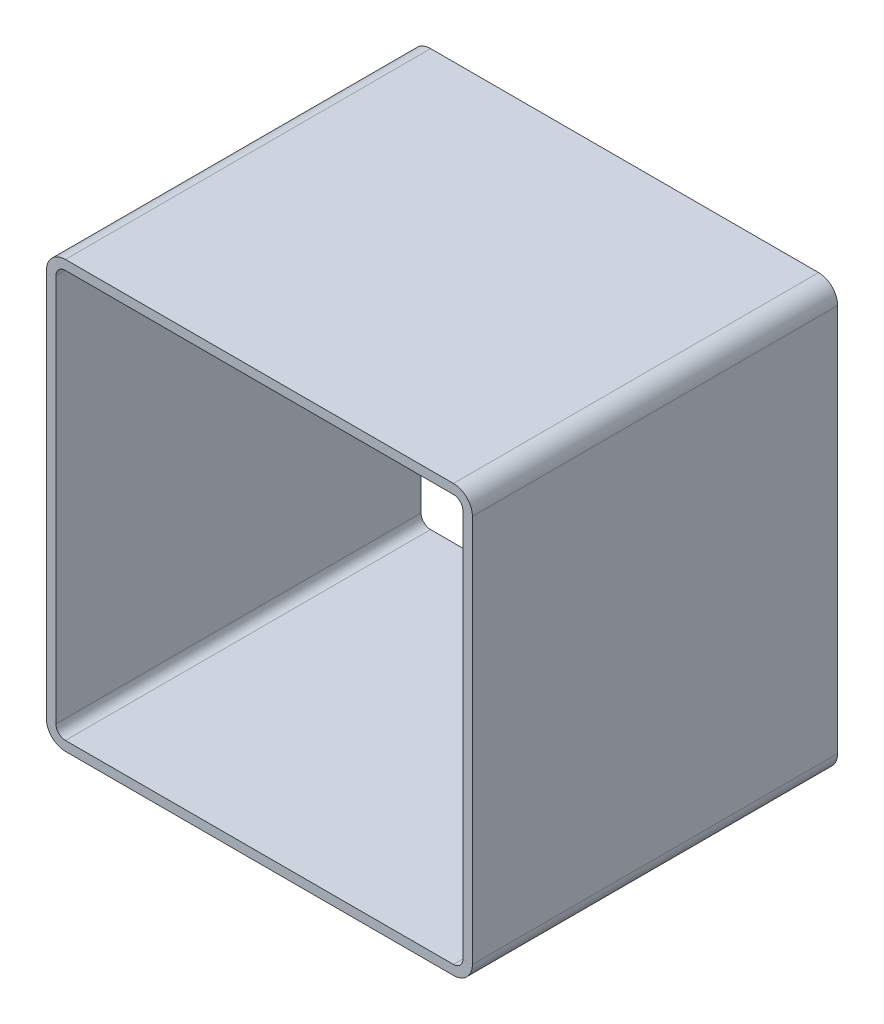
ISO-10303-21;
HEADER;
FILE_DESCRIPTION(('STEP AP214'),'2;1');
FILE_NAME('part.step','',(''),(''),'','','');
FILE_SCHEMA(('AUTOMOTIVE_DESIGN { 1 0 10303 214 1 1 1 1 }'));
ENDSEC;
DATA;
#1=APPLICATION_CONTEXT('core data for automotive mechanical design processes');
#2=APPLICATION_PROTOCOL_DEFINITION('international standard','automotive_design',2000,#1);
#3=PRODUCT_CONTEXT('',#1,'mechanical');
#4=PRODUCT('Part','Part','',(#3));
#5=PRODUCT_RELATED_PRODUCT_CATEGORY('part','',(#4));
#6=PRODUCT_DEFINITION_FORMATION('','',#4);
#7=PRODUCT_DEFINITION_CONTEXT('part definition',#1,'design');
#8=PRODUCT_DEFINITION('design','',#6,#7);
#9=PRODUCT_DEFINITION_SHAPE('','',#8);
#10=(LENGTH_UNIT() NAMED_UNIT(*) SI_UNIT(.MILLI.,.METRE.));
#11=(NAMED_UNIT(*) PLANE_ANGLE_UNIT() SI_UNIT($,.RADIAN.));
#12=(NAMED_UNIT(*) SI_UNIT($,.STERADIAN.) SOLID_ANGLE_UNIT());
#13=UNCERTAINTY_MEASURE_WITH_UNIT(LENGTH_MEASURE(1.E-05),#10,'distance_accuracy_value','');
#14=(GEOMETRIC_REPRESENTATION_CONTEXT(3) GLOBAL_UNCERTAINTY_ASSIGNED_CONTEXT((#13)) GLOBAL_UNIT_ASSIGNED_CONTEXT((#10,
#11,#12)) REPRESENTATION_CONTEXT('',''));
#15=CARTESIAN_POINT('',(0.,0.,0.));
#16=DIRECTION('',(0.,0.,1.));
#17=DIRECTION('',(1.,0.,0.));
#18=AXIS2_PLACEMENT_3D('',#15,#16,#17);
#19=CARTESIAN_POINT('',(18.3253420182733,341.553679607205,304.8));
#20=DIRECTION('',(0.,0.,1.));
#21=DIRECTION('',(1.,0.,0.));
#22=AXIS2_PLACEMENT_3D('',#19,#20,#21);
#23=PLANE('',#22);
#24=CARTESIAN_POINT('',(18.3253420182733,341.553679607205,304.8));
#25=DIRECTION('',(0.,0.,1.));
#26=DIRECTION('',(1.,0.,0.));
#27=AXIS2_PLACEMENT_3D('',#24,#25,#26);
#28=CIRCLE('',#27,15.875);
#29=CARTESIAN_POINT('',(18.3253420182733,357.428679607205,304.8));
#30=VERTEX_POINT('',#29);
#31=CARTESIAN_POINT('',(2.45034201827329,341.553679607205,304.8));
#32=VERTEX_POINT('',#31);
#33=EDGE_CURVE('E211',#30,#32,#28,.T.);
#34=ORIENTED_EDGE('',*,*,#33,.T.);
#35=DIRECTION('',(0.,-1.,0.));
#36=VECTOR('',#35,1.);
#37=CARTESIAN_POINT('',(2.45034201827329,17.7036796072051,304.8));
#38=LINE('',#37,#36);
#39=CARTESIAN_POINT('',(2.4503420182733,17.7036796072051,304.8));
#40=VERTEX_POINT('',#39);
#41=EDGE_CURVE('E214',#32,#40,#38,.T.);
#42=ORIENTED_EDGE('',*,*,#41,.T.);
#43=CARTESIAN_POINT('',(18.3253420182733,17.7036796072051,304.8));
#44=DIRECTION('',(0.,0.,1.));
#45=DIRECTION('',(1.,0.,0.));
#46=AXIS2_PLACEMENT_3D('',#43,#44,#45);
#47=CIRCLE('',#46,15.875);
#48=CARTESIAN_POINT('',(18.3253420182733,1.82867960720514,304.8));
#49=VERTEX_POINT('',#48);
#50=EDGE_CURVE('E217',#40,#49,#47,.T.);
#51=ORIENTED_EDGE('',*,*,#50,.T.);
#52=DIRECTION('',(1.,0.,0.));
#53=VECTOR('',#52,1.);
#54=CARTESIAN_POINT('',(342.175342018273,1.82867960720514,304.8));
#55=LINE('',#54,#53);
#56=CARTESIAN_POINT('',(342.175342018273,1.82867960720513,304.8));
#57=VERTEX_POINT('',#56);
#58=EDGE_CURVE('E219',#49,#57,#55,.T.);
#59=ORIENTED_EDGE('',*,*,#58,.T.);
#60=CARTESIAN_POINT('',(342.175342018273,17.7036796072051,304.8));
#61=DIRECTION('',(0.,0.,1.));
#62=DIRECTION('',(1.,0.,0.));
#63=AXIS2_PLACEMENT_3D('',#60,#61,#62);
#64=CIRCLE('',#63,15.875);
#65=CARTESIAN_POINT('',(358.050342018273,17.7036796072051,304.8));
#66=VERTEX_POINT('',#65);
#67=EDGE_CURVE('E221',#57,#66,#64,.T.);
#68=ORIENTED_EDGE('',*,*,#67,.T.);
#69=DIRECTION('',(0.,1.,0.));
#70=VECTOR('',#69,1.);
#71=CARTESIAN_POINT('',(358.050342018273,341.553679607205,304.8));
#72=LINE('',#71,#70);
#73=CARTESIAN_POINT('',(358.050342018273,341.553679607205,304.8));
#74=VERTEX_POINT('',#73);
#75=EDGE_CURVE('E223',#66,#74,#72,.T.);
#76=ORIENTED_EDGE('',*,*,#75,.T.);
#77=CARTESIAN_POINT('',(342.175342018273,341.553679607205,304.8));
#78=DIRECTION('',(0.,0.,1.));
#79=DIRECTION('',(1.,0.,0.));
#80=AXIS2_PLACEMENT_3D('',#77,#78,#79);
#81=CIRCLE('',#80,15.875);
#82=CARTESIAN_POINT('',(342.175342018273,357.428679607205,304.8));
#83=VERTEX_POINT('',#82);
#84=EDGE_CURVE('E225',#74,#83,#81,.T.);
#85=ORIENTED_EDGE('',*,*,#84,.T.);
#86=DIRECTION('',(-1.,0.,0.));
#87=VECTOR('',#86,1.);
#88=CARTESIAN_POINT('',(18.3253420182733,357.428679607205,304.8));
#89=LINE('',#88,#87);
#90=EDGE_CURVE('E227',#83,#30,#89,.T.);
#91=ORIENTED_EDGE('',*,*,#90,.T.);
#92=EDGE_LOOP('',(#34,#42,#51,#59,#68,#76,#85,#91));
#93=FACE_BOUND('',#92,.T.);
#94=DIRECTION('',(0.,-1.,0.));
#95=VECTOR('',#94,1.);
#96=CARTESIAN_POINT('',(10.3878420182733,17.7036796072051,304.8));
#97=LINE('',#96,#95);
#98=CARTESIAN_POINT('',(10.3878420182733,341.553679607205,304.8));
#99=VERTEX_POINT('',#98);
#100=CARTESIAN_POINT('',(10.3878420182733,17.7036796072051,304.8));
#101=VERTEX_POINT('',#100);
#102=EDGE_CURVE('E154',#99,#101,#97,.T.);
#103=ORIENTED_EDGE('',*,*,#102,.F.);
#104=CARTESIAN_POINT('',(18.3253420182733,341.553679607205,304.8));
#105=DIRECTION('',(0.,0.,1.));
#106=DIRECTION('',(1.,0.,0.));
#107=AXIS2_PLACEMENT_3D('',#104,#105,#106);
#108=CIRCLE('',#107,7.93749999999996);
#109=CARTESIAN_POINT('',(18.3253420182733,349.491179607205,304.8));
#110=VERTEX_POINT('',#109);
#111=EDGE_CURVE('E146',#110,#99,#108,.T.);
#112=ORIENTED_EDGE('',*,*,#111,.F.);
#113=DIRECTION('',(-1.,0.,0.));
#114=VECTOR('',#113,1.);
#115=CARTESIAN_POINT('',(18.3253420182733,349.491179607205,304.8));
#116=LINE('',#115,#114);
#117=CARTESIAN_POINT('',(342.175342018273,349.491179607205,304.8));
#118=VERTEX_POINT('',#117);
#119=EDGE_CURVE('E179',#118,#110,#116,.T.);
#120=ORIENTED_EDGE('',*,*,#119,.F.);
#121=CARTESIAN_POINT('',(342.175342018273,341.553679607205,304.8));
#122=DIRECTION('',(0.,0.,1.));
#123=DIRECTION('',(1.,0.,0.));
#124=AXIS2_PLACEMENT_3D('',#121,#122,#123);
#125=CIRCLE('',#124,7.93749999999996);
#126=CARTESIAN_POINT('',(350.112842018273,341.553679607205,304.8));
#127=VERTEX_POINT('',#126);
#128=EDGE_CURVE('E177',#127,#118,#125,.T.);
#129=ORIENTED_EDGE('',*,*,#128,.F.);
#130=DIRECTION('',(0.,1.,0.));
#131=VECTOR('',#130,1.);
#132=CARTESIAN_POINT('',(350.112842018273,341.553679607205,304.8));
#133=LINE('',#132,#131);
#134=CARTESIAN_POINT('',(350.112842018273,17.7036796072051,304.8));
#135=VERTEX_POINT('',#134);
#136=EDGE_CURVE('E175',#135,#127,#133,.T.);
#137=ORIENTED_EDGE('',*,*,#136,.F.);
#138=CARTESIAN_POINT('',(342.175342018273,17.7036796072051,304.8));
#139=DIRECTION('',(0.,0.,1.));
#140=DIRECTION('',(1.,0.,0.));
#141=AXIS2_PLACEMENT_3D('',#138,#139,#140);
#142=CIRCLE('',#141,7.9375);
#143=CARTESIAN_POINT('',(342.175342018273,9.76617960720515,304.8));
#144=VERTEX_POINT('',#143);
#145=EDGE_CURVE('E173',#144,#135,#142,.T.);
#146=ORIENTED_EDGE('',*,*,#145,.F.);
#147=DIRECTION('',(1.,0.,0.));
#148=VECTOR('',#147,1.);
#149=CARTESIAN_POINT('',(342.175342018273,9.76617960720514,304.8));
#150=LINE('',#149,#148);
#151=CARTESIAN_POINT('',(18.3253420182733,9.76617960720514,304.8));
#152=VERTEX_POINT('',#151);
#153=EDGE_CURVE('E169',#152,#144,#150,.T.);
#154=ORIENTED_EDGE('',*,*,#153,.F.);
#155=CARTESIAN_POINT('',(18.3253420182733,17.7036796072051,304.8));
#156=DIRECTION('',(0.,0.,1.));
#157=DIRECTION('',(1.,0.,0.));
#158=AXIS2_PLACEMENT_3D('',#155,#156,#157);
#159=CIRCLE('',#158,7.9375);
#160=EDGE_CURVE('E167',#101,#152,#159,.T.);
#161=ORIENTED_EDGE('',*,*,#160,.F.);
#162=EDGE_LOOP('',(#103,#112,#120,#129,#137,#146,#154,#161));
#163=FACE_BOUND('',#162,.T.);
#164=ADVANCED_FACE('F33',(#93,#163),#23,.T.);
#165=CARTESIAN_POINT('',(18.3253420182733,341.553679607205,0.));
#166=DIRECTION('',(0.,0.,1.));
#167=DIRECTION('',(1.,0.,0.));
#168=AXIS2_PLACEMENT_3D('',#165,#166,#167);
#169=PLANE('',#168);
#170=CARTESIAN_POINT('',(18.3253420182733,341.553679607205,0.));
#171=DIRECTION('',(0.,0.,1.));
#172=DIRECTION('',(1.,0.,0.));
#173=AXIS2_PLACEMENT_3D('',#170,#171,#172);
#174=CIRCLE('',#173,15.875);
#175=CARTESIAN_POINT('',(18.3253420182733,357.428679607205,0.));
#176=VERTEX_POINT('',#175);
#177=CARTESIAN_POINT('',(2.45034201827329,341.553679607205,0.));
#178=VERTEX_POINT('',#177);
#179=EDGE_CURVE('E162',#176,#178,#174,.T.);
#180=ORIENTED_EDGE('',*,*,#179,.F.);
#181=DIRECTION('',(-1.,0.,0.));
#182=VECTOR('',#181,1.);
#183=CARTESIAN_POINT('',(18.3253420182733,357.428679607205,0.));
#184=LINE('',#183,#182);
#185=CARTESIAN_POINT('',(342.175342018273,357.428679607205,0.));
#186=VERTEX_POINT('',#185);
#187=EDGE_CURVE('E215',#186,#176,#184,.T.);
#188=ORIENTED_EDGE('',*,*,#187,.F.);
#189=CARTESIAN_POINT('',(342.175342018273,341.553679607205,0.));
#190=DIRECTION('',(0.,0.,1.));
#191=DIRECTION('',(1.,0.,0.));
#192=AXIS2_PLACEMENT_3D('',#189,#190,#191);
#193=CIRCLE('',#192,15.875);
#194=CARTESIAN_POINT('',(358.050342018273,341.553679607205,0.));
#195=VERTEX_POINT('',#194);
#196=EDGE_CURVE('E242',#195,#186,#193,.T.);
#197=ORIENTED_EDGE('',*,*,#196,.F.);
#198=DIRECTION('',(0.,1.,0.));
#199=VECTOR('',#198,1.);
#200=CARTESIAN_POINT('',(358.050342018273,341.553679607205,0.));
#201=LINE('',#200,#199);
#202=CARTESIAN_POINT('',(358.050342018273,17.7036796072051,0.));
#203=VERTEX_POINT('',#202);
#204=EDGE_CURVE('E240',#203,#195,#201,.T.);
#205=ORIENTED_EDGE('',*,*,#204,.F.);
#206=CARTESIAN_POINT('',(342.175342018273,17.7036796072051,0.));
#207=DIRECTION('',(0.,0.,1.));
#208=DIRECTION('',(1.,0.,0.));
#209=AXIS2_PLACEMENT_3D('',#206,#207,#208);
#210=CIRCLE('',#209,15.875);
#211=CARTESIAN_POINT('',(342.175342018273,1.82867960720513,0.));
#212=VERTEX_POINT('',#211);
#213=EDGE_CURVE('E238',#212,#203,#210,.T.);
#214=ORIENTED_EDGE('',*,*,#213,.F.);
#215=DIRECTION('',(1.,0.,0.));
#216=VECTOR('',#215,1.);
#217=CARTESIAN_POINT('',(342.175342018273,1.82867960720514,0.));
#218=LINE('',#217,#216);
#219=CARTESIAN_POINT('',(18.3253420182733,1.82867960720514,0.));
#220=VERTEX_POINT('',#219);
#221=EDGE_CURVE('E236',#220,#212,#218,.T.);
#222=ORIENTED_EDGE('',*,*,#221,.F.);
#223=CARTESIAN_POINT('',(18.3253420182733,17.7036796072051,0.));
#224=DIRECTION('',(0.,0.,1.));
#225=DIRECTION('',(1.,0.,0.));
#226=AXIS2_PLACEMENT_3D('',#223,#224,#225);
#227=CIRCLE('',#226,15.875);
#228=CARTESIAN_POINT('',(2.4503420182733,17.7036796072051,0.));
#229=VERTEX_POINT('',#228);
#230=EDGE_CURVE('E234',#229,#220,#227,.T.);
#231=ORIENTED_EDGE('',*,*,#230,.F.);
#232=DIRECTION('',(0.,-1.,0.));
#233=VECTOR('',#232,1.);
#234=CARTESIAN_POINT('',(2.45034201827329,17.7036796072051,0.));
#235=LINE('',#234,#233);
#236=EDGE_CURVE('E232',#178,#229,#235,.T.);
#237=ORIENTED_EDGE('',*,*,#236,.F.);
#238=EDGE_LOOP('',(#180,#188,#197,#205,#214,#222,#231,#237));
#239=FACE_BOUND('',#238,.T.);
#240=CARTESIAN_POINT('',(18.3253420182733,341.553679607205,0.));
#241=DIRECTION('',(0.,0.,1.));
#242=DIRECTION('',(1.,0.,0.));
#243=AXIS2_PLACEMENT_3D('',#240,#241,#242);
#244=CIRCLE('',#243,7.93749999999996);
#245=CARTESIAN_POINT('',(18.3253420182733,349.491179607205,0.));
#246=VERTEX_POINT('',#245);
#247=CARTESIAN_POINT('',(10.3878420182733,341.553679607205,0.));
#248=VERTEX_POINT('',#247);
#249=EDGE_CURVE('E56',#246,#248,#244,.T.);
#250=ORIENTED_EDGE('',*,*,#249,.T.);
#251=DIRECTION('',(0.,-1.,0.));
#252=VECTOR('',#251,1.);
#253=CARTESIAN_POINT('',(10.3878420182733,17.7036796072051,0.));
#254=LINE('',#253,#252);
#255=CARTESIAN_POINT('',(10.3878420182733,17.7036796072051,0.));
#256=VERTEX_POINT('',#255);
#257=EDGE_CURVE('E161',#248,#256,#254,.T.);
#258=ORIENTED_EDGE('',*,*,#257,.T.);
#259=CARTESIAN_POINT('',(18.3253420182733,17.7036796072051,0.));
#260=DIRECTION('',(0.,0.,1.));
#261=DIRECTION('',(1.,0.,0.));
#262=AXIS2_PLACEMENT_3D('',#259,#260,#261);
#263=CIRCLE('',#262,7.9375);
#264=CARTESIAN_POINT('',(18.3253420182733,9.76617960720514,0.));
#265=VERTEX_POINT('',#264);
#266=EDGE_CURVE('E183',#256,#265,#263,.T.);
#267=ORIENTED_EDGE('',*,*,#266,.T.);
#268=DIRECTION('',(1.,0.,0.));
#269=VECTOR('',#268,1.);
#270=CARTESIAN_POINT('',(342.175342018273,9.76617960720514,0.));
#271=LINE('',#270,#269);
#272=CARTESIAN_POINT('',(342.175342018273,9.76617960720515,0.));
#273=VERTEX_POINT('',#272);
#274=EDGE_CURVE('E186',#265,#273,#271,.T.);
#275=ORIENTED_EDGE('',*,*,#274,.T.);
#276=CARTESIAN_POINT('',(342.175342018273,17.7036796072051,0.));
#277=DIRECTION('',(0.,0.,1.));
#278=DIRECTION('',(1.,0.,0.));
#279=AXIS2_PLACEMENT_3D('',#276,#277,#278);
#280=CIRCLE('',#279,7.9375);
#281=CARTESIAN_POINT('',(350.112842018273,17.7036796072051,0.));
#282=VERTEX_POINT('',#281);
#283=EDGE_CURVE('E189',#273,#282,#280,.T.);
#284=ORIENTED_EDGE('',*,*,#283,.T.);
#285=DIRECTION('',(0.,1.,0.));
#286=VECTOR('',#285,1.);
#287=CARTESIAN_POINT('',(350.112842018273,341.553679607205,0.));
#288=LINE('',#287,#286);
#289=CARTESIAN_POINT('',(350.112842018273,341.553679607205,0.));
#290=VERTEX_POINT('',#289);
#291=EDGE_CURVE('E192',#282,#290,#288,.T.);
#292=ORIENTED_EDGE('',*,*,#291,.T.);
#293=CARTESIAN_POINT('',(342.175342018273,341.553679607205,0.));
#294=DIRECTION('',(0.,0.,1.));
#295=DIRECTION('',(1.,0.,0.));
#296=AXIS2_PLACEMENT_3D('',#293,#294,#295);
#297=CIRCLE('',#296,7.93749999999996);
#298=CARTESIAN_POINT('',(342.175342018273,349.491179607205,0.));
#299=VERTEX_POINT('',#298);
#300=EDGE_CURVE('E195',#290,#299,#297,.T.);
#301=ORIENTED_EDGE('',*,*,#300,.T.);
#302=DIRECTION('',(-1.,0.,0.));
#303=VECTOR('',#302,1.);
#304=CARTESIAN_POINT('',(18.3253420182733,349.491179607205,0.));
#305=LINE('',#304,#303);
#306=EDGE_CURVE('E155',#299,#246,#305,.T.);
#307=ORIENTED_EDGE('',*,*,#306,.T.);
#308=EDGE_LOOP('',(#250,#258,#267,#275,#284,#292,#301,#307));
#309=FACE_BOUND('',#308,.T.);
#310=ADVANCED_FACE('F272',(#239,#309),#169,.F.);
#311=CARTESIAN_POINT('',(18.3253420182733,341.553679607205,304.8));
#312=DIRECTION('',(0.,0.,-1.));
#313=DIRECTION('',(-1.,0.,0.));
#314=AXIS2_PLACEMENT_3D('',#311,#312,#313);
#315=CYLINDRICAL_SURFACE('',#314,15.875);
#316=ORIENTED_EDGE('',*,*,#179,.T.);
#317=DIRECTION('',(0.,0.,-1.));
#318=VECTOR('',#317,1.);
#319=CARTESIAN_POINT('',(2.45034201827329,341.553679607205,304.8));
#320=LINE('',#319,#318);
#321=EDGE_CURVE('E11',#32,#178,#320,.T.);
#322=ORIENTED_EDGE('',*,*,#321,.F.);
#323=ORIENTED_EDGE('',*,*,#33,.F.);
#324=DIRECTION('',(0.,0.,-1.));
#325=VECTOR('',#324,1.);
#326=CARTESIAN_POINT('',(18.3253420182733,357.428679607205,304.8));
#327=LINE('',#326,#325);
#328=EDGE_CURVE('E229',#30,#176,#327,.T.);
#329=ORIENTED_EDGE('',*,*,#328,.T.);
#330=EDGE_LOOP('',(#316,#322,#323,#329));
#331=FACE_BOUND('',#330,.T.);
#332=ADVANCED_FACE('F35',(#331),#315,.T.);
#333=CARTESIAN_POINT('',(2.45034201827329,17.7036796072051,304.8));
#334=DIRECTION('',(1.,0.,0.));
#335=DIRECTION('',(0.,0.,-1.));
#336=AXIS2_PLACEMENT_3D('',#333,#334,#335);
#337=PLANE('',#336);
#338=ORIENTED_EDGE('',*,*,#236,.T.);
#339=DIRECTION('',(0.,0.,-1.));
#340=VECTOR('',#339,1.);
#341=CARTESIAN_POINT('',(2.4503420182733,17.7036796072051,304.8));
#342=LINE('',#341,#340);
#343=EDGE_CURVE('E41',#40,#229,#342,.T.);
#344=ORIENTED_EDGE('',*,*,#343,.F.);
#345=ORIENTED_EDGE('',*,*,#41,.F.);
#346=ORIENTED_EDGE('',*,*,#321,.T.);
#347=EDGE_LOOP('',(#338,#344,#345,#346));
#348=FACE_BOUND('',#347,.T.);
#349=ADVANCED_FACE('F289',(#348),#337,.F.);
#350=CARTESIAN_POINT('',(18.3253420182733,17.7036796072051,304.8));
#351=DIRECTION('',(0.,0.,-1.));
#352=DIRECTION('',(-1.,0.,0.));
#353=AXIS2_PLACEMENT_3D('',#350,#351,#352);
#354=CYLINDRICAL_SURFACE('',#353,15.875);
#355=ORIENTED_EDGE('',*,*,#230,.T.);
#356=DIRECTION('',(0.,0.,-1.));
#357=VECTOR('',#356,1.);
#358=CARTESIAN_POINT('',(18.3253420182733,1.82867960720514,304.8));
#359=LINE('',#358,#357);
#360=EDGE_CURVE('E259',#49,#220,#359,.T.);
#361=ORIENTED_EDGE('',*,*,#360,.F.);
#362=ORIENTED_EDGE('',*,*,#50,.F.);
#363=ORIENTED_EDGE('',*,*,#343,.T.);
#364=EDGE_LOOP('',(#355,#361,#362,#363));
#365=FACE_BOUND('',#364,.T.);
#366=ADVANCED_FACE('F266',(#365),#354,.T.);
#367=CARTESIAN_POINT('',(342.175342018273,1.82867960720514,304.8));
#368=DIRECTION('',(0.,1.,0.));
#369=DIRECTION('',(0.,0.,1.));
#370=AXIS2_PLACEMENT_3D('',#367,#368,#369);
#371=PLANE('',#370);
#372=ORIENTED_EDGE('',*,*,#221,.T.);
#373=DIRECTION('',(0.,0.,-1.));
#374=VECTOR('',#373,1.);
#375=CARTESIAN_POINT('',(342.175342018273,1.82867960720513,304.8));
#376=LINE('',#375,#374);
#377=EDGE_CURVE('E256',#57,#212,#376,.T.);
#378=ORIENTED_EDGE('',*,*,#377,.F.);
#379=ORIENTED_EDGE('',*,*,#58,.F.);
#380=ORIENTED_EDGE('',*,*,#360,.T.);
#381=EDGE_LOOP('',(#372,#378,#379,#380));
#382=FACE_BOUND('',#381,.T.);
#383=ADVANCED_FACE('F278',(#382),#371,.F.);
#384=CARTESIAN_POINT('',(342.175342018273,17.7036796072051,304.8));
#385=DIRECTION('',(0.,0.,-1.));
#386=DIRECTION('',(-1.,0.,0.));
#387=AXIS2_PLACEMENT_3D('',#384,#385,#386);
#388=CYLINDRICAL_SURFACE('',#387,15.875);
#389=ORIENTED_EDGE('',*,*,#213,.T.);
#390=DIRECTION('',(0.,0.,-1.));
#391=VECTOR('',#390,1.);
#392=CARTESIAN_POINT('',(358.050342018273,17.7036796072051,304.8));
#393=LINE('',#392,#391);
#394=EDGE_CURVE('E253',#66,#203,#393,.T.);
#395=ORIENTED_EDGE('',*,*,#394,.F.);
#396=ORIENTED_EDGE('',*,*,#67,.F.);
#397=ORIENTED_EDGE('',*,*,#377,.T.);
#398=EDGE_LOOP('',(#389,#395,#396,#397));
#399=FACE_BOUND('',#398,.T.);
#400=ADVANCED_FACE('F282',(#399),#388,.T.);
#401=CARTESIAN_POINT('',(358.050342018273,341.553679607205,304.8));
#402=DIRECTION('',(-1.,0.,0.));
#403=DIRECTION('',(0.,0.,1.));
#404=AXIS2_PLACEMENT_3D('',#401,#402,#403);
#405=PLANE('',#404);
#406=ORIENTED_EDGE('',*,*,#204,.T.);
#407=DIRECTION('',(0.,0.,-1.));
#408=VECTOR('',#407,1.);
#409=CARTESIAN_POINT('',(358.050342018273,341.553679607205,304.8));
#410=LINE('',#409,#408);
#411=EDGE_CURVE('E250',#74,#195,#410,.T.);
#412=ORIENTED_EDGE('',*,*,#411,.F.);
#413=ORIENTED_EDGE('',*,*,#75,.F.);
#414=ORIENTED_EDGE('',*,*,#394,.T.);
#415=EDGE_LOOP('',(#406,#412,#413,#414));
#416=FACE_BOUND('',#415,.T.);
#417=ADVANCED_FACE('F302',(#416),#405,.F.);
#418=CARTESIAN_POINT('',(342.175342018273,341.553679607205,304.8));
#419=DIRECTION('',(0.,0.,-1.));
#420=DIRECTION('',(-1.,0.,0.));
#421=AXIS2_PLACEMENT_3D('',#418,#419,#420);
#422=CYLINDRICAL_SURFACE('',#421,15.875);
#423=ORIENTED_EDGE('',*,*,#196,.T.);
#424=DIRECTION('',(0.,0.,-1.));
#425=VECTOR('',#424,1.);
#426=CARTESIAN_POINT('',(342.175342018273,357.428679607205,304.8));
#427=LINE('',#426,#425);
#428=EDGE_CURVE('E247',#83,#186,#427,.T.);
#429=ORIENTED_EDGE('',*,*,#428,.F.);
#430=ORIENTED_EDGE('',*,*,#84,.F.);
#431=ORIENTED_EDGE('',*,*,#411,.T.);
#432=EDGE_LOOP('',(#423,#429,#430,#431));
#433=FACE_BOUND('',#432,.T.);
#434=ADVANCED_FACE('F300',(#433),#422,.T.);
#435=CARTESIAN_POINT('',(18.3253420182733,357.428679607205,304.8));
#436=DIRECTION('',(0.,-1.,0.));
#437=DIRECTION('',(0.,0.,-1.));
#438=AXIS2_PLACEMENT_3D('',#435,#436,#437);
#439=PLANE('',#438);
#440=ORIENTED_EDGE('',*,*,#187,.T.);
#441=ORIENTED_EDGE('',*,*,#328,.F.);
#442=ORIENTED_EDGE('',*,*,#90,.F.);
#443=ORIENTED_EDGE('',*,*,#428,.T.);
#444=EDGE_LOOP('',(#440,#441,#442,#443));
#445=FACE_BOUND('',#444,.T.);
#446=ADVANCED_FACE('F295',(#445),#439,.F.);
#447=CARTESIAN_POINT('',(18.3253420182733,341.553679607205,304.8));
#448=DIRECTION('',(0.,0.,-1.));
#449=DIRECTION('',(-1.,0.,0.));
#450=AXIS2_PLACEMENT_3D('',#447,#448,#449);
#451=CYLINDRICAL_SURFACE('',#450,7.93749999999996);
#452=ORIENTED_EDGE('',*,*,#249,.F.);
#453=DIRECTION('',(0.,0.,-1.));
#454=VECTOR('',#453,1.);
#455=CARTESIAN_POINT('',(18.3253420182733,349.491179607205,304.8));
#456=LINE('',#455,#454);
#457=EDGE_CURVE('E150',#110,#246,#456,.T.);
#458=ORIENTED_EDGE('',*,*,#457,.F.);
#459=ORIENTED_EDGE('',*,*,#111,.T.);
#460=DIRECTION('',(0.,0.,-1.));
#461=VECTOR('',#460,1.);
#462=CARTESIAN_POINT('',(10.3878420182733,341.553679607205,304.8));
#463=LINE('',#462,#461);
#464=EDGE_CURVE('E149',#99,#248,#463,.T.);
#465=ORIENTED_EDGE('',*,*,#464,.T.);
#466=EDGE_LOOP('',(#452,#458,#459,#465));
#467=FACE_BOUND('',#466,.T.);
#468=ADVANCED_FACE('F148',(#467),#451,.F.);
#469=CARTESIAN_POINT('',(10.3878420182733,17.7036796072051,304.8));
#470=DIRECTION('',(1.,0.,0.));
#471=DIRECTION('',(0.,0.,-1.));
#472=AXIS2_PLACEMENT_3D('',#469,#470,#471);
#473=PLANE('',#472);
#474=ORIENTED_EDGE('',*,*,#257,.F.);
#475=ORIENTED_EDGE('',*,*,#464,.F.);
#476=ORIENTED_EDGE('',*,*,#102,.T.);
#477=DIRECTION('',(0.,0.,-1.));
#478=VECTOR('',#477,1.);
#479=CARTESIAN_POINT('',(10.3878420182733,17.7036796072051,304.8));
#480=LINE('',#479,#478);
#481=EDGE_CURVE('E163',#101,#256,#480,.T.);
#482=ORIENTED_EDGE('',*,*,#481,.T.);
#483=EDGE_LOOP('',(#474,#475,#476,#482));
#484=FACE_BOUND('',#483,.T.);
#485=ADVANCED_FACE('F158',(#484),#473,.T.);
#486=CARTESIAN_POINT('',(18.3253420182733,17.7036796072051,304.8));
#487=DIRECTION('',(0.,0.,-1.));
#488=DIRECTION('',(-1.,0.,0.));
#489=AXIS2_PLACEMENT_3D('',#486,#487,#488);
#490=CYLINDRICAL_SURFACE('',#489,7.9375);
#491=ORIENTED_EDGE('',*,*,#266,.F.);
#492=ORIENTED_EDGE('',*,*,#481,.F.);
#493=ORIENTED_EDGE('',*,*,#160,.T.);
#494=DIRECTION('',(0.,0.,-1.));
#495=VECTOR('',#494,1.);
#496=CARTESIAN_POINT('',(18.3253420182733,9.76617960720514,304.8));
#497=LINE('',#496,#495);
#498=EDGE_CURVE('E208',#152,#265,#497,.T.);
#499=ORIENTED_EDGE('',*,*,#498,.T.);
#500=EDGE_LOOP('',(#491,#492,#493,#499));
#501=FACE_BOUND('',#500,.T.);
#502=ADVANCED_FACE('F327',(#501),#490,.F.);
#503=CARTESIAN_POINT('',(342.175342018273,9.76617960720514,304.8));
#504=DIRECTION('',(0.,1.,0.));
#505=DIRECTION('',(0.,0.,1.));
#506=AXIS2_PLACEMENT_3D('',#503,#504,#505);
#507=PLANE('',#506);
#508=ORIENTED_EDGE('',*,*,#274,.F.);
#509=ORIENTED_EDGE('',*,*,#498,.F.);
#510=ORIENTED_EDGE('',*,*,#153,.T.);
#511=DIRECTION('',(0.,0.,-1.));
#512=VECTOR('',#511,1.);
#513=CARTESIAN_POINT('',(342.175342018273,9.76617960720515,304.8));
#514=LINE('',#513,#512);
#515=EDGE_CURVE('E206',#144,#273,#514,.T.);
#516=ORIENTED_EDGE('',*,*,#515,.T.);
#517=EDGE_LOOP('',(#508,#509,#510,#516));
#518=FACE_BOUND('',#517,.T.);
#519=ADVANCED_FACE('F331',(#518),#507,.T.);
#520=CARTESIAN_POINT('',(342.175342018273,17.7036796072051,304.8));
#521=DIRECTION('',(0.,0.,-1.));
#522=DIRECTION('',(-1.,0.,0.));
#523=AXIS2_PLACEMENT_3D('',#520,#521,#522);
#524=CYLINDRICAL_SURFACE('',#523,7.9375);
#525=ORIENTED_EDGE('',*,*,#283,.F.);
#526=ORIENTED_EDGE('',*,*,#515,.F.);
#527=ORIENTED_EDGE('',*,*,#145,.T.);
#528=DIRECTION('',(0.,0.,-1.));
#529=VECTOR('',#528,1.);
#530=CARTESIAN_POINT('',(350.112842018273,17.7036796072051,304.8));
#531=LINE('',#530,#529);
#532=EDGE_CURVE('E204',#135,#282,#531,.T.);
#533=ORIENTED_EDGE('',*,*,#532,.T.);
#534=EDGE_LOOP('',(#525,#526,#527,#533));
#535=FACE_BOUND('',#534,.T.);
#536=ADVANCED_FACE('F337',(#535),#524,.F.);
#537=CARTESIAN_POINT('',(350.112842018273,341.553679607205,304.8));
#538=DIRECTION('',(-1.,0.,0.));
#539=DIRECTION('',(0.,0.,1.));
#540=AXIS2_PLACEMENT_3D('',#537,#538,#539);
#541=PLANE('',#540);
#542=ORIENTED_EDGE('',*,*,#291,.F.);
#543=ORIENTED_EDGE('',*,*,#532,.F.);
#544=ORIENTED_EDGE('',*,*,#136,.T.);
#545=DIRECTION('',(0.,0.,-1.));
#546=VECTOR('',#545,1.);
#547=CARTESIAN_POINT('',(350.112842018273,341.553679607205,304.8));
#548=LINE('',#547,#546);
#549=EDGE_CURVE('E202',#127,#290,#548,.T.);
#550=ORIENTED_EDGE('',*,*,#549,.T.);
#551=EDGE_LOOP('',(#542,#543,#544,#550));
#552=FACE_BOUND('',#551,.T.);
#553=ADVANCED_FACE('F341',(#552),#541,.T.);
#554=CARTESIAN_POINT('',(342.175342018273,341.553679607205,304.8));
#555=DIRECTION('',(0.,0.,-1.));
#556=DIRECTION('',(-1.,0.,0.));
#557=AXIS2_PLACEMENT_3D('',#554,#555,#556);
#558=CYLINDRICAL_SURFACE('',#557,7.93749999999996);
#559=ORIENTED_EDGE('',*,*,#300,.F.);
#560=ORIENTED_EDGE('',*,*,#549,.F.);
#561=ORIENTED_EDGE('',*,*,#128,.T.);
#562=DIRECTION('',(0.,0.,-1.));
#563=VECTOR('',#562,1.);
#564=CARTESIAN_POINT('',(342.175342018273,349.491179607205,304.8));
#565=LINE('',#564,#563);
#566=EDGE_CURVE('E48',#118,#299,#565,.T.);
#567=ORIENTED_EDGE('',*,*,#566,.T.);
#568=EDGE_LOOP('',(#559,#560,#561,#567));
#569=FACE_BOUND('',#568,.T.);
#570=ADVANCED_FACE('F345',(#569),#558,.F.);
#571=CARTESIAN_POINT('',(18.3253420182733,349.491179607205,304.8));
#572=DIRECTION('',(0.,-1.,0.));
#573=DIRECTION('',(0.,0.,-1.));
#574=AXIS2_PLACEMENT_3D('',#571,#572,#573);
#575=PLANE('',#574);
#576=ORIENTED_EDGE('',*,*,#306,.F.);
#577=ORIENTED_EDGE('',*,*,#566,.F.);
#578=ORIENTED_EDGE('',*,*,#119,.T.);
#579=ORIENTED_EDGE('',*,*,#457,.T.);
#580=EDGE_LOOP('',(#576,#577,#578,#579));
#581=FACE_BOUND('',#580,.T.);
#582=ADVANCED_FACE('F349',(#581),#575,.T.);
#583=CLOSED_SHELL('',(#164,#310,#332,#349,#366,#383,#400,#417,#434,#446,#468,#485,#502,#519,
#536,#553,#570,#582));
#584=MANIFOLD_SOLID_BREP('B2',#583);
#585=ADVANCED_BREP_SHAPE_REPRESENTATION('',(#18,#584),#14);
#586=SHAPE_DEFINITION_REPRESENTATION(#9,#585);
ENDSEC;
END-ISO-10303-21;
